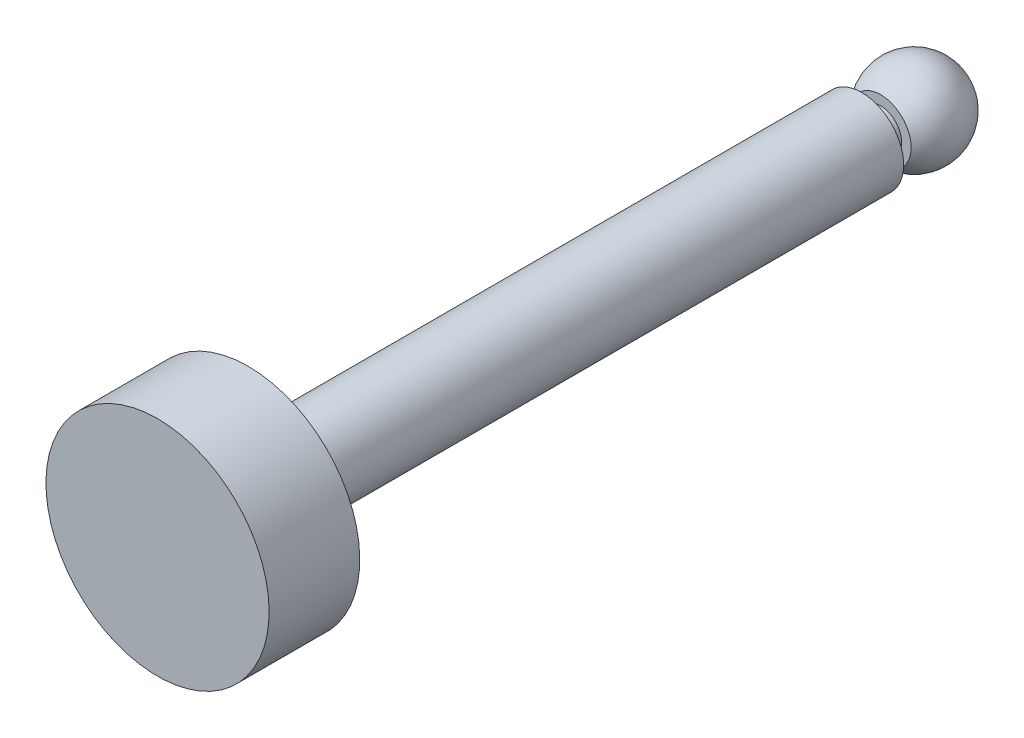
ISO-10303-21;
HEADER;
FILE_DESCRIPTION(('STEP AP214'),'2;1');
FILE_NAME('part.step','',(''),(''),'','','');
FILE_SCHEMA(('AUTOMOTIVE_DESIGN { 1 0 10303 214 1 1 1 1 }'));
ENDSEC;
DATA;
#1=APPLICATION_CONTEXT('core data for automotive mechanical design processes');
#2=APPLICATION_PROTOCOL_DEFINITION('international standard','automotive_design',2000,#1);
#3=PRODUCT_CONTEXT('',#1,'mechanical');
#4=PRODUCT('Part','Part','',(#3));
#5=PRODUCT_RELATED_PRODUCT_CATEGORY('part','',(#4));
#6=PRODUCT_DEFINITION_FORMATION('','',#4);
#7=PRODUCT_DEFINITION_CONTEXT('part definition',#1,'design');
#8=PRODUCT_DEFINITION('design','',#6,#7);
#9=PRODUCT_DEFINITION_SHAPE('','',#8);
#10=(LENGTH_UNIT() NAMED_UNIT(*) SI_UNIT(.MILLI.,.METRE.));
#11=(NAMED_UNIT(*) PLANE_ANGLE_UNIT() SI_UNIT($,.RADIAN.));
#12=(NAMED_UNIT(*) SI_UNIT($,.STERADIAN.) SOLID_ANGLE_UNIT());
#13=UNCERTAINTY_MEASURE_WITH_UNIT(LENGTH_MEASURE(1.E-05),#10,'distance_accuracy_value','');
#14=(GEOMETRIC_REPRESENTATION_CONTEXT(3) GLOBAL_UNCERTAINTY_ASSIGNED_CONTEXT((#13)) GLOBAL_UNIT_ASSIGNED_CONTEXT((#10,
#11,#12)) REPRESENTATION_CONTEXT('',''));
#15=CARTESIAN_POINT('',(0.,0.,0.));
#16=DIRECTION('',(0.,0.,1.));
#17=DIRECTION('',(1.,0.,0.));
#18=AXIS2_PLACEMENT_3D('',#15,#16,#17);
#19=CARTESIAN_POINT('',(0.,-16.,115.));
#20=DIRECTION('',(0.,0.,-1.));
#21=DIRECTION('',(0.,-1.,0.));
#22=AXIS2_PLACEMENT_3D('',#19,#20,#21);
#23=PLANE('',#22);
#24=CARTESIAN_POINT('',(0.,0.,115.));
#25=DIRECTION('',(0.,0.,1.));
#26=DIRECTION('',(0.,1.,0.));
#27=AXIS2_PLACEMENT_3D('',#24,#25,#26);
#28=CIRCLE('',#27,16.);
#29=CARTESIAN_POINT('',(0.,16.,115.));
#30=VERTEX_POINT('',#29);
#31=EDGE_CURVE('E37',#30,#30,#28,.T.);
#32=ORIENTED_EDGE('',*,*,#31,.T.);
#33=EDGE_LOOP('',(#32));
#34=FACE_BOUND('',#33,.T.);
#35=ADVANCED_FACE('F12',(#34),#23,.F.);
#36=CARTESIAN_POINT('',(0.,0.,6.5));
#37=DIRECTION('',(0.,-1.,0.));
#38=DIRECTION('',(-1.,0.,0.));
#39=AXIS2_PLACEMENT_3D('',#36,#37,#38);
#40=SPHERICAL_SURFACE('',#39,6.5);
#41=CARTESIAN_POINT('',(0.,0.,6.5));
#42=DIRECTION('',(0.,0.,1.));
#43=DIRECTION('',(0.,1.,0.));
#44=AXIS2_PLACEMENT_3D('',#41,#42,#43);
#45=SPHERICAL_SURFACE('',#44,6.5);
#46=CARTESIAN_POINT('',(0.,0.,11.3));
#47=DIRECTION('',(0.,0.,1.));
#48=DIRECTION('',(0.,1.,0.));
#49=AXIS2_PLACEMENT_3D('',#46,#47,#48);
#50=CIRCLE('',#49,4.38292140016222);
#51=CARTESIAN_POINT('',(0.,4.38292140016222,11.3));
#52=VERTEX_POINT('',#51);
#53=EDGE_CURVE('E8',#52,#52,#50,.T.);
#54=ORIENTED_EDGE('',*,*,#53,.F.);
#55=EDGE_LOOP('',(#54));
#56=FACE_BOUND('',#55,.T.);
#57=ADVANCED_FACE('F67',(#56),#45,.T.);
#58=CARTESIAN_POINT('',(0.,-4.38292140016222,11.3));
#59=DIRECTION('',(0.,0.,-1.));
#60=DIRECTION('',(0.,-1.,0.));
#61=AXIS2_PLACEMENT_3D('',#58,#59,#60);
#62=PLANE('',#61);
#63=CARTESIAN_POINT('',(0.,0.,11.3));
#64=DIRECTION('',(0.,0.,1.));
#65=DIRECTION('',(0.,1.,0.));
#66=AXIS2_PLACEMENT_3D('',#63,#64,#65);
#67=CIRCLE('',#66,3.);
#68=CARTESIAN_POINT('',(0.,3.,11.3));
#69=VERTEX_POINT('',#68);
#70=EDGE_CURVE('E18',#69,#69,#67,.T.);
#71=ORIENTED_EDGE('',*,*,#70,.F.);
#72=EDGE_LOOP('',(#71));
#73=FACE_BOUND('',#72,.T.);
#74=ORIENTED_EDGE('',*,*,#53,.T.);
#75=EDGE_LOOP('',(#74));
#76=FACE_BOUND('',#75,.T.);
#77=ADVANCED_FACE('F71',(#73,#76),#62,.F.);
#78=CARTESIAN_POINT('',(0.,0.,8.3));
#79=DIRECTION('',(0.,0.,1.));
#80=DIRECTION('',(0.,1.,0.));
#81=AXIS2_PLACEMENT_3D('',#78,#79,#80);
#82=CYLINDRICAL_SURFACE('',#81,3.);
#83=ORIENTED_EDGE('',*,*,#70,.T.);
#84=EDGE_LOOP('',(#83));
#85=FACE_BOUND('',#84,.T.);
#86=CARTESIAN_POINT('',(0.,0.,14.));
#87=DIRECTION('',(0.,0.,1.));
#88=DIRECTION('',(0.,1.,0.));
#89=AXIS2_PLACEMENT_3D('',#86,#87,#88);
#90=CIRCLE('',#89,3.);
#91=CARTESIAN_POINT('',(0.,3.,14.));
#92=VERTEX_POINT('',#91);
#93=EDGE_CURVE('E22',#92,#92,#90,.T.);
#94=ORIENTED_EDGE('',*,*,#93,.F.);
#95=EDGE_LOOP('',(#94));
#96=FACE_BOUND('',#95,.T.);
#97=ADVANCED_FACE('F63',(#85,#96),#82,.T.);
#98=CARTESIAN_POINT('',(0.,-6.,14.));
#99=DIRECTION('',(0.,0.,-1.));
#100=DIRECTION('',(0.,-1.,0.));
#101=AXIS2_PLACEMENT_3D('',#98,#99,#100);
#102=PLANE('',#101);
#103=ORIENTED_EDGE('',*,*,#93,.T.);
#104=EDGE_LOOP('',(#103));
#105=FACE_BOUND('',#104,.T.);
#106=CARTESIAN_POINT('',(0.,0.,14.));
#107=DIRECTION('',(0.,0.,1.));
#108=DIRECTION('',(0.,1.,0.));
#109=AXIS2_PLACEMENT_3D('',#106,#107,#108);
#110=CIRCLE('',#109,6.);
#111=CARTESIAN_POINT('',(0.,6.,14.));
#112=VERTEX_POINT('',#111);
#113=EDGE_CURVE('E26',#112,#112,#110,.T.);
#114=ORIENTED_EDGE('',*,*,#113,.F.);
#115=EDGE_LOOP('',(#114));
#116=FACE_BOUND('',#115,.T.);
#117=ADVANCED_FACE('F56',(#105,#116),#102,.T.);
#118=CARTESIAN_POINT('',(0.,0.,8.3));
#119=DIRECTION('',(0.,0.,1.));
#120=DIRECTION('',(0.,1.,0.));
#121=AXIS2_PLACEMENT_3D('',#118,#119,#120);
#122=CYLINDRICAL_SURFACE('',#121,6.);
#123=ORIENTED_EDGE('',*,*,#113,.T.);
#124=EDGE_LOOP('',(#123));
#125=FACE_BOUND('',#124,.T.);
#126=CARTESIAN_POINT('',(0.,0.,102.));
#127=DIRECTION('',(0.,0.,1.));
#128=DIRECTION('',(0.,1.,0.));
#129=AXIS2_PLACEMENT_3D('',#126,#127,#128);
#130=CIRCLE('',#129,6.);
#131=CARTESIAN_POINT('',(0.,6.,102.));
#132=VERTEX_POINT('',#131);
#133=EDGE_CURVE('E31',#132,#132,#130,.T.);
#134=ORIENTED_EDGE('',*,*,#133,.F.);
#135=EDGE_LOOP('',(#134));
#136=FACE_BOUND('',#135,.T.);
#137=ADVANCED_FACE('F51',(#125,#136),#122,.T.);
#138=CARTESIAN_POINT('',(0.,-6.,102.));
#139=DIRECTION('',(0.,0.,1.));
#140=DIRECTION('',(0.,1.,0.));
#141=AXIS2_PLACEMENT_3D('',#138,#139,#140);
#142=PLANE('',#141);
#143=CARTESIAN_POINT('',(0.,0.,102.));
#144=DIRECTION('',(0.,0.,1.));
#145=DIRECTION('',(0.,1.,0.));
#146=AXIS2_PLACEMENT_3D('',#143,#144,#145);
#147=CIRCLE('',#146,16.);
#148=CARTESIAN_POINT('',(0.,16.,102.));
#149=VERTEX_POINT('',#148);
#150=EDGE_CURVE('E34',#149,#149,#147,.T.);
#151=ORIENTED_EDGE('',*,*,#150,.F.);
#152=EDGE_LOOP('',(#151));
#153=FACE_BOUND('',#152,.T.);
#154=ORIENTED_EDGE('',*,*,#133,.T.);
#155=EDGE_LOOP('',(#154));
#156=FACE_BOUND('',#155,.T.);
#157=ADVANCED_FACE('F45',(#153,#156),#142,.F.);
#158=CARTESIAN_POINT('',(0.,0.,8.3));
#159=DIRECTION('',(0.,0.,1.));
#160=DIRECTION('',(0.,1.,0.));
#161=AXIS2_PLACEMENT_3D('',#158,#159,#160);
#162=CYLINDRICAL_SURFACE('',#161,16.);
#163=ORIENTED_EDGE('',*,*,#31,.F.);
#164=EDGE_LOOP('',(#163));
#165=FACE_BOUND('',#164,.T.);
#166=ORIENTED_EDGE('',*,*,#150,.T.);
#167=EDGE_LOOP('',(#166));
#168=FACE_BOUND('',#167,.T.);
#169=ADVANCED_FACE('F42',(#165,#168),#162,.T.);
#170=CLOSED_SHELL('',(#35,#57,#77,#97,#117,#137,#157,#169));
#171=MANIFOLD_SOLID_BREP('B1',#170);
#172=ADVANCED_BREP_SHAPE_REPRESENTATION('',(#18,#171),#14);
#173=SHAPE_DEFINITION_REPRESENTATION(#9,#172);
ENDSEC;
END-ISO-10303-21;
